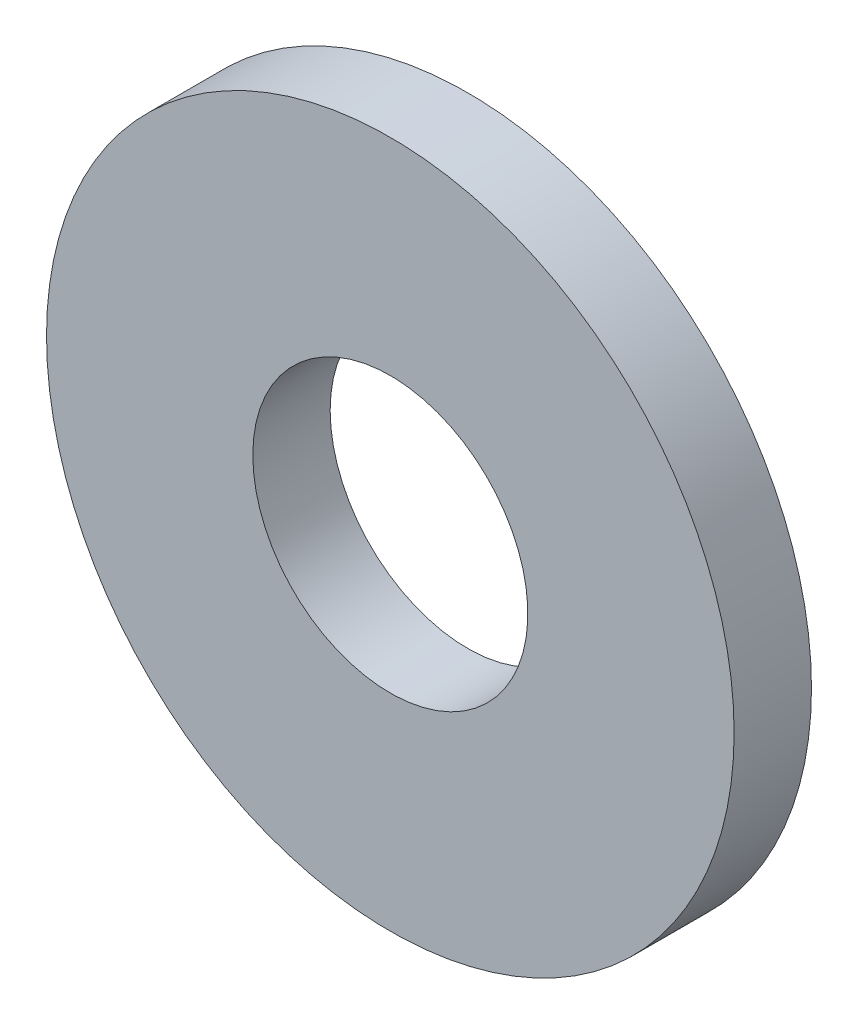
ISO-10303-21;
HEADER;
FILE_DESCRIPTION(('STEP AP214'),'2;1');
FILE_NAME('part.step','',(''),(''),'','','');
FILE_SCHEMA(('AUTOMOTIVE_DESIGN { 1 0 10303 214 1 1 1 1 }'));
ENDSEC;
DATA;
#1=APPLICATION_CONTEXT('core data for automotive mechanical design processes');
#2=APPLICATION_PROTOCOL_DEFINITION('international standard','automotive_design',2000,#1);
#3=PRODUCT_CONTEXT('',#1,'mechanical');
#4=PRODUCT('Part','Part','',(#3));
#5=PRODUCT_RELATED_PRODUCT_CATEGORY('part','',(#4));
#6=PRODUCT_DEFINITION_FORMATION('','',#4);
#7=PRODUCT_DEFINITION_CONTEXT('part definition',#1,'design');
#8=PRODUCT_DEFINITION('design','',#6,#7);
#9=PRODUCT_DEFINITION_SHAPE('','',#8);
#10=(LENGTH_UNIT() NAMED_UNIT(*) SI_UNIT(.MILLI.,.METRE.));
#11=(NAMED_UNIT(*) PLANE_ANGLE_UNIT() SI_UNIT($,.RADIAN.));
#12=(NAMED_UNIT(*) SI_UNIT($,.STERADIAN.) SOLID_ANGLE_UNIT());
#13=UNCERTAINTY_MEASURE_WITH_UNIT(LENGTH_MEASURE(1.E-05),#10,'distance_accuracy_value','');
#14=(GEOMETRIC_REPRESENTATION_CONTEXT(3) GLOBAL_UNCERTAINTY_ASSIGNED_CONTEXT((#13)) GLOBAL_UNIT_ASSIGNED_CONTEXT((#10,
#11,#12)) REPRESENTATION_CONTEXT('',''));
#15=CARTESIAN_POINT('',(0.,0.,0.));
#16=DIRECTION('',(0.,0.,1.));
#17=DIRECTION('',(1.,0.,0.));
#18=AXIS2_PLACEMENT_3D('',#15,#16,#17);
#19=CARTESIAN_POINT('',(0.,0.,4.5));
#20=DIRECTION('',(0.,0.,-1.));
#21=DIRECTION('',(-1.,0.,0.));
#22=AXIS2_PLACEMENT_3D('',#19,#20,#21);
#23=CYLINDRICAL_SURFACE('',#22,20.);
#24=CARTESIAN_POINT('',(0.,0.,4.5));
#25=DIRECTION('',(0.,0.,1.));
#26=DIRECTION('',(1.,0.,0.));
#27=AXIS2_PLACEMENT_3D('',#24,#25,#26);
#28=CIRCLE('',#27,20.);
#29=CARTESIAN_POINT('',(20.,0.,4.5));
#30=VERTEX_POINT('',#29);
#31=EDGE_CURVE('E10',#30,#30,#28,.T.);
#32=ORIENTED_EDGE('',*,*,#31,.F.);
#33=EDGE_LOOP('',(#32));
#34=FACE_BOUND('',#33,.T.);
#35=CARTESIAN_POINT('',(0.,0.,0.));
#36=DIRECTION('',(0.,0.,1.));
#37=DIRECTION('',(1.,0.,0.));
#38=AXIS2_PLACEMENT_3D('',#35,#36,#37);
#39=CIRCLE('',#38,20.);
#40=CARTESIAN_POINT('',(20.,0.,0.));
#41=VERTEX_POINT('',#40);
#42=EDGE_CURVE('E33',#41,#41,#39,.T.);
#43=ORIENTED_EDGE('',*,*,#42,.T.);
#44=EDGE_LOOP('',(#43));
#45=FACE_BOUND('',#44,.T.);
#46=ADVANCED_FACE('F30',(#34,#45),#23,.T.);
#47=CARTESIAN_POINT('',(0.,0.,4.5));
#48=DIRECTION('',(0.,0.,1.));
#49=DIRECTION('',(1.,0.,0.));
#50=AXIS2_PLACEMENT_3D('',#47,#48,#49);
#51=PLANE('',#50);
#52=CARTESIAN_POINT('',(0.,0.,4.5));
#53=DIRECTION('',(0.,0.,-1.));
#54=DIRECTION('',(-1.,0.,0.));
#55=AXIS2_PLACEMENT_3D('',#52,#53,#54);
#56=CIRCLE('',#55,8.);
#57=CARTESIAN_POINT('',(-8.,0.,4.5));
#58=VERTEX_POINT('',#57);
#59=EDGE_CURVE('E40',#58,#58,#56,.T.);
#60=ORIENTED_EDGE('',*,*,#59,.T.);
#61=EDGE_LOOP('',(#60));
#62=FACE_BOUND('',#61,.T.);
#63=ORIENTED_EDGE('',*,*,#31,.T.);
#64=EDGE_LOOP('',(#63));
#65=FACE_BOUND('',#64,.T.);
#66=ADVANCED_FACE('F48',(#62,#65),#51,.T.);
#67=CARTESIAN_POINT('',(0.,0.,0.));
#68=DIRECTION('',(0.,0.,1.));
#69=DIRECTION('',(1.,0.,0.));
#70=AXIS2_PLACEMENT_3D('',#67,#68,#69);
#71=PLANE('',#70);
#72=CARTESIAN_POINT('',(0.,0.,0.));
#73=DIRECTION('',(0.,0.,-1.));
#74=DIRECTION('',(-1.,0.,0.));
#75=AXIS2_PLACEMENT_3D('',#72,#73,#74);
#76=CIRCLE('',#75,8.);
#77=CARTESIAN_POINT('',(-8.,0.,0.));
#78=VERTEX_POINT('',#77);
#79=EDGE_CURVE('E42',#78,#78,#76,.T.);
#80=ORIENTED_EDGE('',*,*,#79,.F.);
#81=EDGE_LOOP('',(#80));
#82=FACE_BOUND('',#81,.T.);
#83=ORIENTED_EDGE('',*,*,#42,.F.);
#84=EDGE_LOOP('',(#83));
#85=FACE_BOUND('',#84,.T.);
#86=ADVANCED_FACE('F53',(#82,#85),#71,.F.);
#87=CARTESIAN_POINT('',(0.,0.,4.5));
#88=DIRECTION('',(0.,0.,-1.));
#89=DIRECTION('',(-1.,0.,0.));
#90=AXIS2_PLACEMENT_3D('',#87,#88,#89);
#91=CYLINDRICAL_SURFACE('',#90,8.);
#92=ORIENTED_EDGE('',*,*,#59,.F.);
#93=EDGE_LOOP('',(#92));
#94=FACE_BOUND('',#93,.T.);
#95=ORIENTED_EDGE('',*,*,#79,.T.);
#96=EDGE_LOOP('',(#95));
#97=FACE_BOUND('',#96,.T.);
#98=ADVANCED_FACE('F50',(#94,#97),#91,.F.);
#99=CLOSED_SHELL('',(#46,#66,#86,#98));
#100=MANIFOLD_SOLID_BREP('B2',#99);
#101=ADVANCED_BREP_SHAPE_REPRESENTATION('',(#18,#100),#14);
#102=SHAPE_DEFINITION_REPRESENTATION(#9,#101);
ENDSEC;
END-ISO-10303-21;
